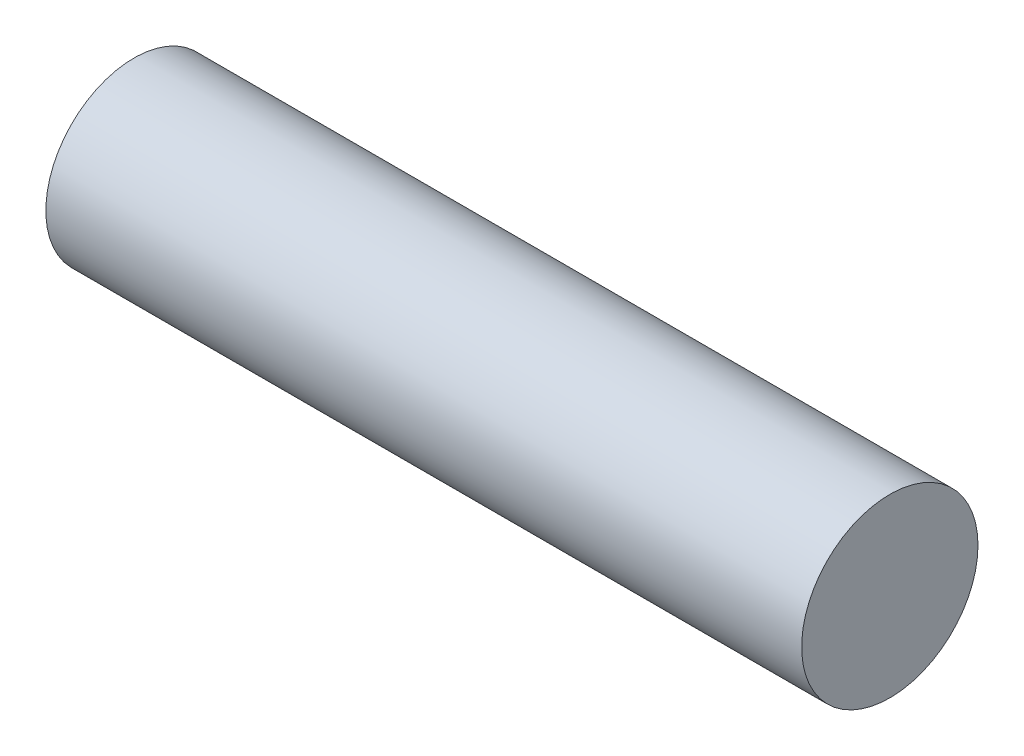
ISO-10303-21;
HEADER;
FILE_DESCRIPTION(('STEP AP214'),'2;1');
FILE_NAME('part.step','',(''),(''),'','','');
FILE_SCHEMA(('AUTOMOTIVE_DESIGN { 1 0 10303 214 1 1 1 1 }'));
ENDSEC;
DATA;
#1=APPLICATION_CONTEXT('core data for automotive mechanical design processes');
#2=APPLICATION_PROTOCOL_DEFINITION('international standard','automotive_design',2000,#1);
#3=PRODUCT_CONTEXT('',#1,'mechanical');
#4=PRODUCT('Part','Part','',(#3));
#5=PRODUCT_RELATED_PRODUCT_CATEGORY('part','',(#4));
#6=PRODUCT_DEFINITION_FORMATION('','',#4);
#7=PRODUCT_DEFINITION_CONTEXT('part definition',#1,'design');
#8=PRODUCT_DEFINITION('design','',#6,#7);
#9=PRODUCT_DEFINITION_SHAPE('','',#8);
#10=(LENGTH_UNIT() NAMED_UNIT(*) SI_UNIT(.MILLI.,.METRE.));
#11=(NAMED_UNIT(*) PLANE_ANGLE_UNIT() SI_UNIT($,.RADIAN.));
#12=(NAMED_UNIT(*) SI_UNIT($,.STERADIAN.) SOLID_ANGLE_UNIT());
#13=UNCERTAINTY_MEASURE_WITH_UNIT(LENGTH_MEASURE(1.E-05),#10,'distance_accuracy_value','');
#14=(GEOMETRIC_REPRESENTATION_CONTEXT(3) GLOBAL_UNCERTAINTY_ASSIGNED_CONTEXT((#13)) GLOBAL_UNIT_ASSIGNED_CONTEXT((#10,
#11,#12)) REPRESENTATION_CONTEXT('',''));
#15=CARTESIAN_POINT('',(0.,0.,0.));
#16=DIRECTION('',(0.,0.,1.));
#17=DIRECTION('',(1.,0.,0.));
#18=AXIS2_PLACEMENT_3D('',#15,#16,#17);
#19=CARTESIAN_POINT('',(150.,0.,0.));
#20=DIRECTION('',(-1.,0.,0.));
#21=DIRECTION('',(0.,0.,1.));
#22=AXIS2_PLACEMENT_3D('',#19,#20,#21);
#23=CYLINDRICAL_SURFACE('',#22,17.5);
#24=CARTESIAN_POINT('',(150.,0.,0.));
#25=DIRECTION('',(1.,0.,0.));
#26=DIRECTION('',(0.,0.,-1.));
#27=AXIS2_PLACEMENT_3D('',#24,#25,#26);
#28=CIRCLE('',#27,17.5);
#29=CARTESIAN_POINT('',(150.,0.,-17.5));
#30=VERTEX_POINT('',#29);
#31=EDGE_CURVE('E10',#30,#30,#28,.T.);
#32=ORIENTED_EDGE('',*,*,#31,.F.);
#33=EDGE_LOOP('',(#32));
#34=FACE_BOUND('',#33,.T.);
#35=CARTESIAN_POINT('',(0.,0.,0.));
#36=DIRECTION('',(1.,0.,0.));
#37=DIRECTION('',(0.,0.,-1.));
#38=AXIS2_PLACEMENT_3D('',#35,#36,#37);
#39=CIRCLE('',#38,17.5);
#40=CARTESIAN_POINT('',(0.,0.,-17.5));
#41=VERTEX_POINT('',#40);
#42=EDGE_CURVE('E40',#41,#41,#39,.T.);
#43=ORIENTED_EDGE('',*,*,#42,.T.);
#44=EDGE_LOOP('',(#43));
#45=FACE_BOUND('',#44,.T.);
#46=ADVANCED_FACE('F37',(#34,#45),#23,.T.);
#47=CARTESIAN_POINT('',(150.,0.,0.));
#48=DIRECTION('',(1.,0.,0.));
#49=DIRECTION('',(0.,0.,-1.));
#50=AXIS2_PLACEMENT_3D('',#47,#48,#49);
#51=PLANE('',#50);
#52=ORIENTED_EDGE('',*,*,#31,.T.);
#53=EDGE_LOOP('',(#52));
#54=FACE_BOUND('',#53,.T.);
#55=ADVANCED_FACE('F54',(#54),#51,.T.);
#56=CARTESIAN_POINT('',(0.,0.,0.));
#57=DIRECTION('',(1.,0.,0.));
#58=DIRECTION('',(0.,0.,-1.));
#59=AXIS2_PLACEMENT_3D('',#56,#57,#58);
#60=PLANE('',#59);
#61=ORIENTED_EDGE('',*,*,#42,.F.);
#62=EDGE_LOOP('',(#61));
#63=FACE_BOUND('',#62,.T.);
#64=ADVANCED_FACE('F52',(#63),#60,.F.);
#65=CLOSED_SHELL('',(#46,#55,#64));
#66=MANIFOLD_SOLID_BREP('B2',#65);
#67=ADVANCED_BREP_SHAPE_REPRESENTATION('',(#18,#66),#14);
#68=SHAPE_DEFINITION_REPRESENTATION(#9,#67);
ENDSEC;
END-ISO-10303-21;
